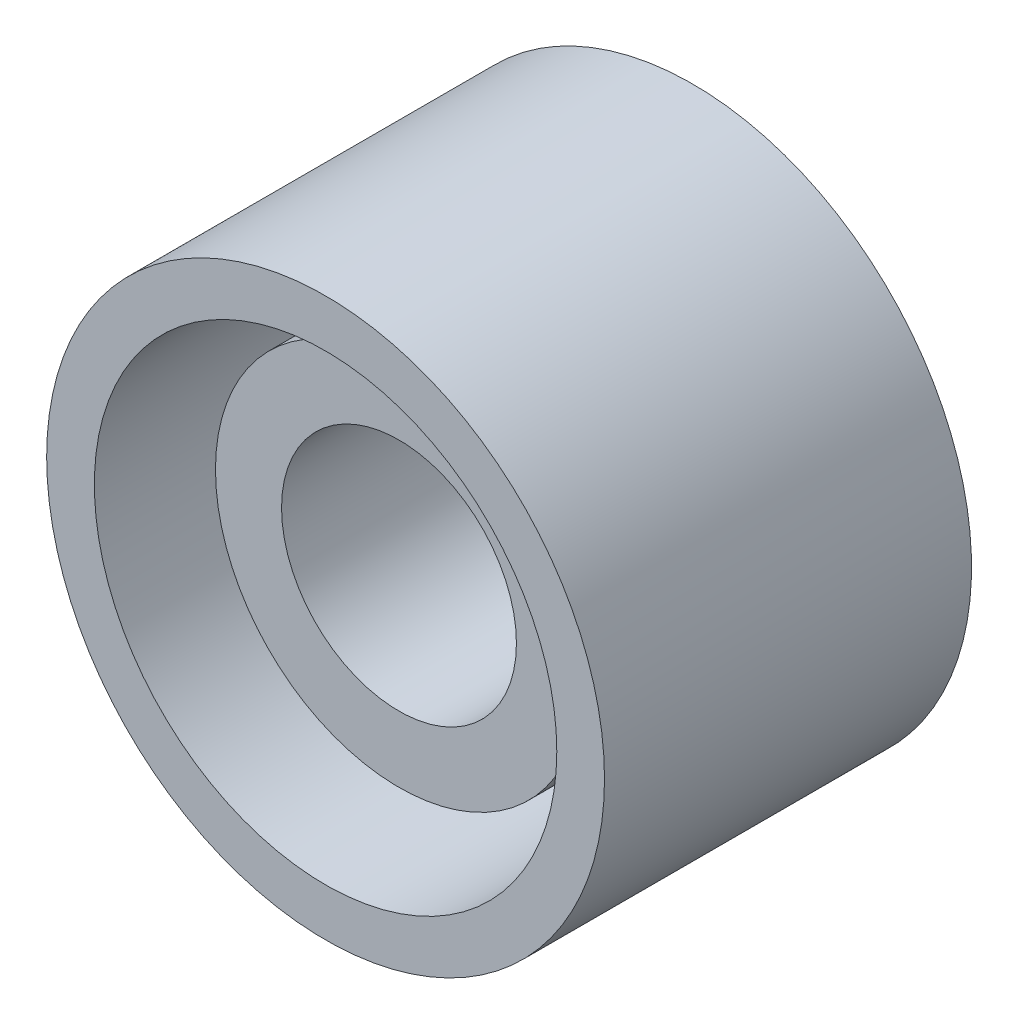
from build123d import *

# Parameters (mm, degrees)
SKETCH_1_R          = 38
SKETCH_1_R_2        = 31.5
EXTRUDE_1_DEPTH     = 30
SKETCH_2_R          = 25
EXTRUDE_2_DEPTH     = 20
EXTRUDE_START       = 20
SKETCH_3_R          = 38
EXTRUDE_3_DEPTH     = 20
SKETCH_4_R          = 16
CUT_EXTRUDE_1_DEPTH = 74.402997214


with BuildPart() as part:
    # Sketch 1 → Extrude 1 (new body)
    with BuildSketch(Plane.XY):
        Circle(SKETCH_1_R)
        Circle(SKETCH_1_R_2, mode=Mode.SUBTRACT)
    extrude(amount=EXTRUDE_1_DEPTH)



with BuildPart() as body_2:
    # Sketch 2 → Extrude 2 (new body)
    with BuildSketch(Plane(origin=(0, 0, 0), x_dir=(-1, 0, 0), z_dir=(0, 0, -1))):
        Circle(SKETCH_2_R)
    extrude(amount=-EXTRUDE_2_DEPTH)


with BuildPart() as part_1:
    add(part.part)

    add(body_2.part)  # Extrude 3 merges body 2
    # Sketch 3 → Extrude 3 (add)
    with BuildSketch(Plane(origin=(0, 0, 0), x_dir=(-1, 0, 0), z_dir=(0, 0, -1)).offset(EXTRUDE_START)):
        Circle(SKETCH_3_R)
    extrude(amount=-EXTRUDE_3_DEPTH)

    # Sketch 4 → Cut-Extrude 1 (cut, through all)
    with BuildSketch(Plane(origin=(0, 0, -20), x_dir=(-1, 0, 0), z_dir=(0, 0, -1))):
        Circle(SKETCH_4_R)
    extrude(amount=-CUT_EXTRUDE_1_DEPTH, mode=Mode.SUBTRACT)


solid = part_1.part
